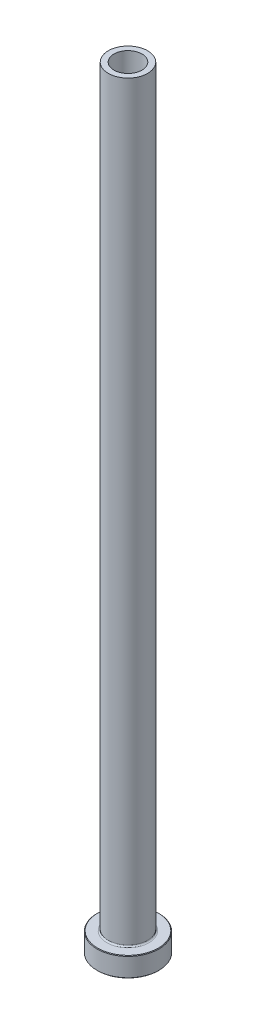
ISO-10303-21;
HEADER;
FILE_DESCRIPTION(('STEP AP214'),'2;1');
FILE_NAME('part.step','',(''),(''),'','','');
FILE_SCHEMA(('AUTOMOTIVE_DESIGN { 1 0 10303 214 1 1 1 1 }'));
ENDSEC;
DATA;
#1=APPLICATION_CONTEXT('core data for automotive mechanical design processes');
#2=APPLICATION_PROTOCOL_DEFINITION('international standard','automotive_design',2000,#1);
#3=PRODUCT_CONTEXT('',#1,'mechanical');
#4=PRODUCT('Part','Part','',(#3));
#5=PRODUCT_RELATED_PRODUCT_CATEGORY('part','',(#4));
#6=PRODUCT_DEFINITION_FORMATION('','',#4);
#7=PRODUCT_DEFINITION_CONTEXT('part definition',#1,'design');
#8=PRODUCT_DEFINITION('design','',#6,#7);
#9=PRODUCT_DEFINITION_SHAPE('','',#8);
#10=(LENGTH_UNIT() NAMED_UNIT(*) SI_UNIT(.MILLI.,.METRE.));
#11=(NAMED_UNIT(*) PLANE_ANGLE_UNIT() SI_UNIT($,.RADIAN.));
#12=(NAMED_UNIT(*) SI_UNIT($,.STERADIAN.) SOLID_ANGLE_UNIT());
#13=UNCERTAINTY_MEASURE_WITH_UNIT(LENGTH_MEASURE(1.E-05),#10,'distance_accuracy_value','');
#14=(GEOMETRIC_REPRESENTATION_CONTEXT(3) GLOBAL_UNCERTAINTY_ASSIGNED_CONTEXT((#13)) GLOBAL_UNIT_ASSIGNED_CONTEXT((#10,
#11,#12)) REPRESENTATION_CONTEXT('',''));
#15=CARTESIAN_POINT('',(0.,0.,0.));
#16=DIRECTION('',(0.,0.,1.));
#17=DIRECTION('',(1.,0.,0.));
#18=AXIS2_PLACEMENT_3D('',#15,#16,#17);
#19=CARTESIAN_POINT('',(0.,92.1876809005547,0.));
#20=DIRECTION('',(0.,1.,0.));
#21=DIRECTION('',(0.,0.,1.));
#22=AXIS2_PLACEMENT_3D('',#19,#20,#21);
#23=CYLINDRICAL_SURFACE('',#22,5.00000000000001);
#24=CARTESIAN_POINT('',(0.,275.,0.));
#25=DIRECTION('',(0.,1.,0.));
#26=DIRECTION('',(0.,0.,1.));
#27=AXIS2_PLACEMENT_3D('',#24,#25,#26);
#28=CIRCLE('',#27,5.00000000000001);
#29=CARTESIAN_POINT('',(0.,275.,5.00000000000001));
#30=VERTEX_POINT('',#29);
#31=EDGE_CURVE('E62',#30,#30,#28,.T.);
#32=ORIENTED_EDGE('',*,*,#31,.T.);
#33=EDGE_LOOP('',(#32));
#34=FACE_BOUND('',#33,.T.);
#35=CARTESIAN_POINT('',(0.,230.,0.));
#36=DIRECTION('',(0.,1.,0.));
#37=DIRECTION('',(0.,0.,1.));
#38=AXIS2_PLACEMENT_3D('',#35,#36,#37);
#39=CIRCLE('',#38,5.00000000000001);
#40=CARTESIAN_POINT('',(0.,230.,5.00000000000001));
#41=VERTEX_POINT('',#40);
#42=EDGE_CURVE('E71',#41,#41,#39,.T.);
#43=ORIENTED_EDGE('',*,*,#42,.F.);
#44=EDGE_LOOP('',(#43));
#45=FACE_BOUND('',#44,.T.);
#46=ADVANCED_FACE('F30',(#34,#45),#23,.F.);
#47=CARTESIAN_POINT('',(-5.00000000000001,275.,0.));
#48=DIRECTION('',(0.,1.,0.));
#49=DIRECTION('',(0.,0.,1.));
#50=AXIS2_PLACEMENT_3D('',#47,#48,#49);
#51=PLANE('',#50);
#52=CARTESIAN_POINT('',(0.,275.,0.));
#53=DIRECTION('',(0.,1.,0.));
#54=DIRECTION('',(0.,0.,1.));
#55=AXIS2_PLACEMENT_3D('',#52,#53,#54);
#56=CIRCLE('',#55,7.00000000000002);
#57=CARTESIAN_POINT('',(0.,275.,7.00000000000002));
#58=VERTEX_POINT('',#57);
#59=EDGE_CURVE('E65',#58,#58,#56,.T.);
#60=ORIENTED_EDGE('',*,*,#59,.T.);
#61=EDGE_LOOP('',(#60));
#62=FACE_BOUND('',#61,.T.);
#63=ORIENTED_EDGE('',*,*,#31,.F.);
#64=EDGE_LOOP('',(#63));
#65=FACE_BOUND('',#64,.T.);
#66=ADVANCED_FACE('F79',(#62,#65),#51,.T.);
#67=CARTESIAN_POINT('',(0.,92.1876809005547,0.));
#68=DIRECTION('',(0.,1.,0.));
#69=DIRECTION('',(0.,0.,1.));
#70=AXIS2_PLACEMENT_3D('',#67,#68,#69);
#71=CYLINDRICAL_SURFACE('',#70,7.00000000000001);
#72=CARTESIAN_POINT('',(0.,7.50000000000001,0.));
#73=DIRECTION('',(0.,1.,0.));
#74=DIRECTION('',(0.,0.,1.));
#75=AXIS2_PLACEMENT_3D('',#72,#73,#74);
#76=CIRCLE('',#75,7.00000000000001);
#77=CARTESIAN_POINT('',(0.,7.50000000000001,7.00000000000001));
#78=VERTEX_POINT('',#77);
#79=EDGE_CURVE('E59',#78,#78,#76,.T.);
#80=ORIENTED_EDGE('',*,*,#79,.T.);
#81=EDGE_LOOP('',(#80));
#82=FACE_BOUND('',#81,.T.);
#83=ORIENTED_EDGE('',*,*,#59,.F.);
#84=EDGE_LOOP('',(#83));
#85=FACE_BOUND('',#84,.T.);
#86=ADVANCED_FACE('F85',(#82,#85),#71,.T.);
#87=CARTESIAN_POINT('',(-6.99999999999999,7.,0.));
#88=DIRECTION('',(0.,1.,0.));
#89=DIRECTION('',(0.,0.,1.));
#90=AXIS2_PLACEMENT_3D('',#87,#88,#89);
#91=PLANE('',#90);
#92=CARTESIAN_POINT('',(0.,7.,0.));
#93=DIRECTION('',(0.,1.,0.));
#94=DIRECTION('',(0.,0.,1.));
#95=AXIS2_PLACEMENT_3D('',#92,#93,#94);
#96=CIRCLE('',#95,10.8);
#97=CARTESIAN_POINT('',(0.,7.,10.8));
#98=VERTEX_POINT('',#97);
#99=EDGE_CURVE('E53',#98,#98,#96,.T.);
#100=ORIENTED_EDGE('',*,*,#99,.T.);
#101=EDGE_LOOP('',(#100));
#102=FACE_BOUND('',#101,.T.);
#103=CARTESIAN_POINT('',(0.,7.,0.));
#104=DIRECTION('',(0.,1.,0.));
#105=DIRECTION('',(0.,0.,1.));
#106=AXIS2_PLACEMENT_3D('',#103,#104,#105);
#107=CIRCLE('',#106,7.50000000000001);
#108=CARTESIAN_POINT('',(0.,7.,7.50000000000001));
#109=VERTEX_POINT('',#108);
#110=EDGE_CURVE('E56',#109,#109,#107,.F.);
#111=ORIENTED_EDGE('',*,*,#110,.T.);
#112=EDGE_LOOP('',(#111));
#113=FACE_BOUND('',#112,.T.);
#114=ADVANCED_FACE('F111',(#102,#113),#91,.T.);
#115=CARTESIAN_POINT('',(0.,92.1876809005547,0.));
#116=DIRECTION('',(0.,1.,0.));
#117=DIRECTION('',(0.,0.,1.));
#118=AXIS2_PLACEMENT_3D('',#115,#116,#117);
#119=CYLINDRICAL_SURFACE('',#118,11.);
#120=CARTESIAN_POINT('',(0.,6.79999999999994,0.));
#121=DIRECTION('',(0.,1.,0.));
#122=DIRECTION('',(0.,0.,1.));
#123=AXIS2_PLACEMENT_3D('',#120,#121,#122);
#124=CIRCLE('',#123,11.);
#125=CARTESIAN_POINT('',(0.,6.79999999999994,11.));
#126=VERTEX_POINT('',#125);
#127=EDGE_CURVE('E45',#126,#126,#124,.F.);
#128=ORIENTED_EDGE('',*,*,#127,.T.);
#129=EDGE_LOOP('',(#128));
#130=FACE_BOUND('',#129,.T.);
#131=CARTESIAN_POINT('',(0.,0.199999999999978,0.));
#132=DIRECTION('',(0.,-1.,0.));
#133=DIRECTION('',(0.,0.,-1.));
#134=AXIS2_PLACEMENT_3D('',#131,#132,#133);
#135=CIRCLE('',#134,11.);
#136=CARTESIAN_POINT('',(0.,0.199999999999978,11.));
#137=VERTEX_POINT('',#136);
#138=EDGE_CURVE('E50',#137,#137,#135,.F.);
#139=ORIENTED_EDGE('',*,*,#138,.T.);
#140=EDGE_LOOP('',(#139));
#141=FACE_BOUND('',#140,.T.);
#142=ADVANCED_FACE('F108',(#130,#141),#119,.T.);
#143=CARTESIAN_POINT('',(-11.,0.,0.));
#144=DIRECTION('',(0.,-1.,0.));
#145=DIRECTION('',(0.,0.,-1.));
#146=AXIS2_PLACEMENT_3D('',#143,#144,#145);
#147=PLANE('',#146);
#148=CARTESIAN_POINT('',(0.,0.,0.));
#149=DIRECTION('',(0.,-1.,0.));
#150=DIRECTION('',(0.,0.,-1.));
#151=AXIS2_PLACEMENT_3D('',#148,#149,#150);
#152=CIRCLE('',#151,5.75000000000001);
#153=CARTESIAN_POINT('',(0.,0.,-5.75000000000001));
#154=VERTEX_POINT('',#153);
#155=EDGE_CURVE('E37',#154,#154,#152,.F.);
#156=ORIENTED_EDGE('',*,*,#155,.T.);
#157=EDGE_LOOP('',(#156));
#158=FACE_BOUND('',#157,.T.);
#159=CARTESIAN_POINT('',(0.,0.,0.));
#160=DIRECTION('',(0.,-1.,0.));
#161=DIRECTION('',(0.,0.,-1.));
#162=AXIS2_PLACEMENT_3D('',#159,#160,#161);
#163=CIRCLE('',#162,10.8);
#164=CARTESIAN_POINT('',(0.,0.,10.8));
#165=VERTEX_POINT('',#164);
#166=EDGE_CURVE('E41',#165,#165,#163,.T.);
#167=ORIENTED_EDGE('',*,*,#166,.T.);
#168=EDGE_LOOP('',(#167));
#169=FACE_BOUND('',#168,.T.);
#170=ADVANCED_FACE('F110',(#158,#169),#147,.T.);
#171=CARTESIAN_POINT('',(0.,92.1876809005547,0.));
#172=DIRECTION('',(0.,1.,0.));
#173=DIRECTION('',(0.,0.,1.));
#174=AXIS2_PLACEMENT_3D('',#171,#172,#173);
#175=CYLINDRICAL_SURFACE('',#174,5.25);
#176=CARTESIAN_POINT('',(0.,0.500000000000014,0.));
#177=DIRECTION('',(0.,-1.,0.));
#178=DIRECTION('',(0.,0.,-1.));
#179=AXIS2_PLACEMENT_3D('',#176,#177,#178);
#180=CIRCLE('',#179,5.25);
#181=CARTESIAN_POINT('',(0.,0.500000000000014,-5.25));
#182=VERTEX_POINT('',#181);
#183=EDGE_CURVE('E10',#182,#182,#180,.T.);
#184=ORIENTED_EDGE('',*,*,#183,.T.);
#185=EDGE_LOOP('',(#184));
#186=FACE_BOUND('',#185,.T.);
#187=CARTESIAN_POINT('',(0.,218.,0.));
#188=DIRECTION('',(0.,1.,0.));
#189=DIRECTION('',(0.,0.,1.));
#190=AXIS2_PLACEMENT_3D('',#187,#188,#189);
#191=CIRCLE('',#190,5.25000000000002);
#192=CARTESIAN_POINT('',(0.,218.,5.25000000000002));
#193=VERTEX_POINT('',#192);
#194=EDGE_CURVE('E68',#193,#193,#191,.T.);
#195=ORIENTED_EDGE('',*,*,#194,.T.);
#196=EDGE_LOOP('',(#195));
#197=FACE_BOUND('',#196,.T.);
#198=ADVANCED_FACE('F118',(#186,#197),#175,.F.);
#199=CARTESIAN_POINT('',(0.,218.,0.));
#200=DIRECTION('',(0.,-1.,0.));
#201=DIRECTION('',(0.,0.,-1.));
#202=AXIS2_PLACEMENT_3D('',#199,#200,#201);
#203=CONICAL_SURFACE('',#202,5.25000000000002,0.0208303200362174);
#204=ORIENTED_EDGE('',*,*,#42,.T.);
#205=EDGE_LOOP('',(#204));
#206=FACE_BOUND('',#205,.T.);
#207=ORIENTED_EDGE('',*,*,#194,.F.);
#208=EDGE_LOOP('',(#207));
#209=FACE_BOUND('',#208,.T.);
#210=ADVANCED_FACE('F75',(#206,#209),#203,.F.);
#211=CARTESIAN_POINT('',(0.,7.50000000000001,0.));
#212=DIRECTION('',(0.,1.,0.));
#213=DIRECTION('',(0.,0.,1.));
#214=AXIS2_PLACEMENT_3D('',#211,#212,#213);
#215=TOROIDAL_SURFACE('',#214,7.50000000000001,0.5);
#216=ORIENTED_EDGE('',*,*,#110,.F.);
#217=EDGE_LOOP('',(#216));
#218=FACE_BOUND('',#217,.T.);
#219=ORIENTED_EDGE('',*,*,#79,.F.);
#220=EDGE_LOOP('',(#219));
#221=FACE_BOUND('',#220,.T.);
#222=ADVANCED_FACE('F90',(#218,#221),#215,.F.);
#223=CARTESIAN_POINT('',(0.,7.00000000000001,0.));
#224=DIRECTION('',(0.,-1.,0.));
#225=DIRECTION('',(0.,0.,-1.));
#226=AXIS2_PLACEMENT_3D('',#223,#224,#225);
#227=CONICAL_SURFACE('',#226,10.7999999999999,0.785398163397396);
#228=ORIENTED_EDGE('',*,*,#127,.F.);
#229=EDGE_LOOP('',(#228));
#230=FACE_BOUND('',#229,.T.);
#231=ORIENTED_EDGE('',*,*,#99,.F.);
#232=EDGE_LOOP('',(#231));
#233=FACE_BOUND('',#232,.T.);
#234=ADVANCED_FACE('F93',(#230,#233),#227,.T.);
#235=CARTESIAN_POINT('',(0.,0.199999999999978,0.));
#236=DIRECTION('',(0.,1.,0.));
#237=DIRECTION('',(0.,0.,1.));
#238=AXIS2_PLACEMENT_3D('',#235,#236,#237);
#239=CONICAL_SURFACE('',#238,11.,0.785398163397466);
#240=CARTESIAN_POINT('',(0.,0.,10.8));
#241=CARTESIAN_POINT('',(0.,0.00208333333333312,10.8020833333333));
#242=CARTESIAN_POINT('',(0.,0.00416666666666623,10.8041666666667));
#243=CARTESIAN_POINT('',(0.,0.00833333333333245,10.8083333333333));
#244=CARTESIAN_POINT('',(0.,0.0104166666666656,10.8104166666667));
#245=CARTESIAN_POINT('',(0.,0.0145833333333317,10.8145833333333));
#246=CARTESIAN_POINT('',(0.,0.0166666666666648,10.8166666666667));
#247=CARTESIAN_POINT('',(0.,0.0208333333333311,10.8208333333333));
#248=CARTESIAN_POINT('',(0.,0.0229166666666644,10.8229166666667));
#249=CARTESIAN_POINT('',(0.,0.0270833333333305,10.8270833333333));
#250=CARTESIAN_POINT('',(0.,0.0291666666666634,10.8291666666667));
#251=CARTESIAN_POINT('',(0.,0.0333333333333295,10.8333333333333));
#252=CARTESIAN_POINT('',(0.,0.0354166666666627,10.8354166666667));
#253=CARTESIAN_POINT('',(0.,0.0395833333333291,10.8395833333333));
#254=CARTESIAN_POINT('',(0.,0.0416666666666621,10.8416666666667));
#255=CARTESIAN_POINT('',(0.,0.0458333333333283,10.8458333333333));
#256=CARTESIAN_POINT('',(0.,0.0479166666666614,10.8479166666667));
#257=CARTESIAN_POINT('',(0.,0.0520833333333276,10.8520833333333));
#258=CARTESIAN_POINT('',(0.,0.0541666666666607,10.8541666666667));
#259=CARTESIAN_POINT('',(0.,0.0583333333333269,10.8583333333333));
#260=CARTESIAN_POINT('',(0.,0.06041666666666,10.8604166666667));
#261=CARTESIAN_POINT('',(0.,0.0645833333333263,10.8645833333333));
#262=CARTESIAN_POINT('',(0.,0.0666666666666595,10.8666666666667));
#263=CARTESIAN_POINT('',(0.,0.0708333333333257,10.8708333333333));
#264=CARTESIAN_POINT('',(0.,0.0729166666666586,10.8729166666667));
#265=CARTESIAN_POINT('',(0.,0.0770833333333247,10.8770833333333));
#266=CARTESIAN_POINT('',(0.,0.0791666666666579,10.8791666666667));
#267=CARTESIAN_POINT('',(0.,0.0833333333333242,10.8833333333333));
#268=CARTESIAN_POINT('',(0.,0.0854166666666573,10.8854166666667));
#269=CARTESIAN_POINT('',(0.,0.0895833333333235,10.8895833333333));
#270=CARTESIAN_POINT('',(0.,0.0916666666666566,10.8916666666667));
#271=CARTESIAN_POINT('',(0.,0.0958333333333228,10.8958333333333));
#272=CARTESIAN_POINT('',(0.,0.0979166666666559,10.8979166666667));
#273=CARTESIAN_POINT('',(0.,0.102083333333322,10.9020833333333));
#274=CARTESIAN_POINT('',(0.,0.104166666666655,10.9041666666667));
#275=CARTESIAN_POINT('',(0.,0.108333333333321,10.9083333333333));
#276=CARTESIAN_POINT('',(0.,0.110416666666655,10.9104166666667));
#277=CARTESIAN_POINT('',(0.,0.114583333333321,10.9145833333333));
#278=CARTESIAN_POINT('',(0.,0.116666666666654,10.9166666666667));
#279=CARTESIAN_POINT('',(0.,0.12083333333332,10.9208333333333));
#280=CARTESIAN_POINT('',(0.,0.122916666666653,10.9229166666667));
#281=CARTESIAN_POINT('',(0.,0.127083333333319,10.9270833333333));
#282=CARTESIAN_POINT('',(0.,0.129166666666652,10.9291666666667));
#283=CARTESIAN_POINT('',(0.,0.133333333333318,10.9333333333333));
#284=CARTESIAN_POINT('',(0.,0.135416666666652,10.9354166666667));
#285=CARTESIAN_POINT('',(0.,0.139583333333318,10.9395833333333));
#286=CARTESIAN_POINT('',(0.,0.141666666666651,10.9416666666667));
#287=CARTESIAN_POINT('',(0.,0.145833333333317,10.9458333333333));
#288=CARTESIAN_POINT('',(0.,0.14791666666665,10.9479166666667));
#289=CARTESIAN_POINT('',(0.,0.152083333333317,10.9520833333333));
#290=CARTESIAN_POINT('',(0.,0.15416666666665,10.9541666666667));
#291=CARTESIAN_POINT('',(0.,0.158333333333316,10.9583333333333));
#292=CARTESIAN_POINT('',(0.,0.160416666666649,10.9604166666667));
#293=CARTESIAN_POINT('',(0.,0.164583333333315,10.9645833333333));
#294=CARTESIAN_POINT('',(0.,0.166666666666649,10.9666666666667));
#295=CARTESIAN_POINT('',(0.,0.170833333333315,10.9708333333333));
#296=CARTESIAN_POINT('',(0.,0.172916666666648,10.9729166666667));
#297=CARTESIAN_POINT('',(0.,0.177083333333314,10.9770833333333));
#298=CARTESIAN_POINT('',(0.,0.179166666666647,10.9791666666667));
#299=CARTESIAN_POINT('',(0.,0.183333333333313,10.9833333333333));
#300=CARTESIAN_POINT('',(0.,0.185416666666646,10.9854166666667));
#301=CARTESIAN_POINT('',(0.,0.189583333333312,10.9895833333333));
#302=CARTESIAN_POINT('',(0.,0.191666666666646,10.9916666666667));
#303=CARTESIAN_POINT('',(0.,0.195833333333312,10.9958333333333));
#304=CARTESIAN_POINT('',(0.,0.197916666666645,10.9979166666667));
#305=CARTESIAN_POINT('',(0.,0.199999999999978,11.));
#306=B_SPLINE_CURVE_WITH_KNOTS('',3,(#240,#241,#242,#243,#244,#245,#246,#247,#248,#249,#250,
#251,#252,#253,#254,#255,#256,#257,#258,#259,#260,#261,#262,#263,#264,#265,#266,#267,#268,#269,
#270,#271,#272,#273,#274,#275,#276,#277,#278,#279,#280,#281,#282,#283,#284,#285,#286,#287,#288,
#289,#290,#291,#292,#293,#294,#295,#296,#297,#298,#299,#300,#301,#302,#303,#304,#305),
.UNSPECIFIED.,.F.,.F.,(4,2,2,2,2,2,2,2,2,2,2,2,2,2,2,2,2,2,2,2,2,2,2,2,2,2,2,2,2,2,2,2,4),(0.,
0.00883883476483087,0.0176776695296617,0.0265165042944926,0.0353553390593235,0.0441941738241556,
0.0530330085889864,0.0618718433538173,0.0707106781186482,0.079549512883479,0.0883883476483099,
0.0972271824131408,0.106066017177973,0.114904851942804,0.123743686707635,0.132582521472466,
0.141421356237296,0.150260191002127,0.159099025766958,0.167937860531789,0.17677669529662,
0.185615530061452,0.194454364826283,0.203293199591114,0.212132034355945,0.220970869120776,
0.229809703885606,0.238648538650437,0.247487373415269,0.2563262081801,0.265165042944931,
0.274003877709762,0.282842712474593),.UNSPECIFIED.);
#307=EDGE_CURVE('BSEAM96',#165,#137,#306,.T.);
#308=ORIENTED_EDGE('',*,*,#166,.F.);
#309=ORIENTED_EDGE('',*,*,#138,.F.);
#310=ORIENTED_EDGE('',*,*,#307,.T.);
#311=ORIENTED_EDGE('',*,*,#307,.F.);
#312=EDGE_LOOP('',(#308,#310,#309,#311));
#313=FACE_BOUND('',#312,.T.);
#314=ADVANCED_FACE('F96',(#313),#239,.T.);
#315=CARTESIAN_POINT('',(0.,0.,0.));
#316=DIRECTION('',(0.,-1.,0.));
#317=DIRECTION('',(0.,0.,-1.));
#318=AXIS2_PLACEMENT_3D('',#315,#316,#317);
#319=CONICAL_SURFACE('',#318,5.75000000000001,0.785398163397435);
#320=ORIENTED_EDGE('',*,*,#183,.F.);
#321=EDGE_LOOP('',(#320));
#322=FACE_BOUND('',#321,.T.);
#323=ORIENTED_EDGE('',*,*,#155,.F.);
#324=EDGE_LOOP('',(#323));
#325=FACE_BOUND('',#324,.T.);
#326=ADVANCED_FACE('F32',(#322,#325),#319,.F.);
#327=CLOSED_SHELL('',(#46,#66,#86,#114,#142,#170,#198,#210,#222,#234,#314,#326));
#328=MANIFOLD_SOLID_BREP('B2',#327);
#329=ADVANCED_BREP_SHAPE_REPRESENTATION('',(#18,#328),#14);
#330=SHAPE_DEFINITION_REPRESENTATION(#9,#329);
ENDSEC;
END-ISO-10303-21;
